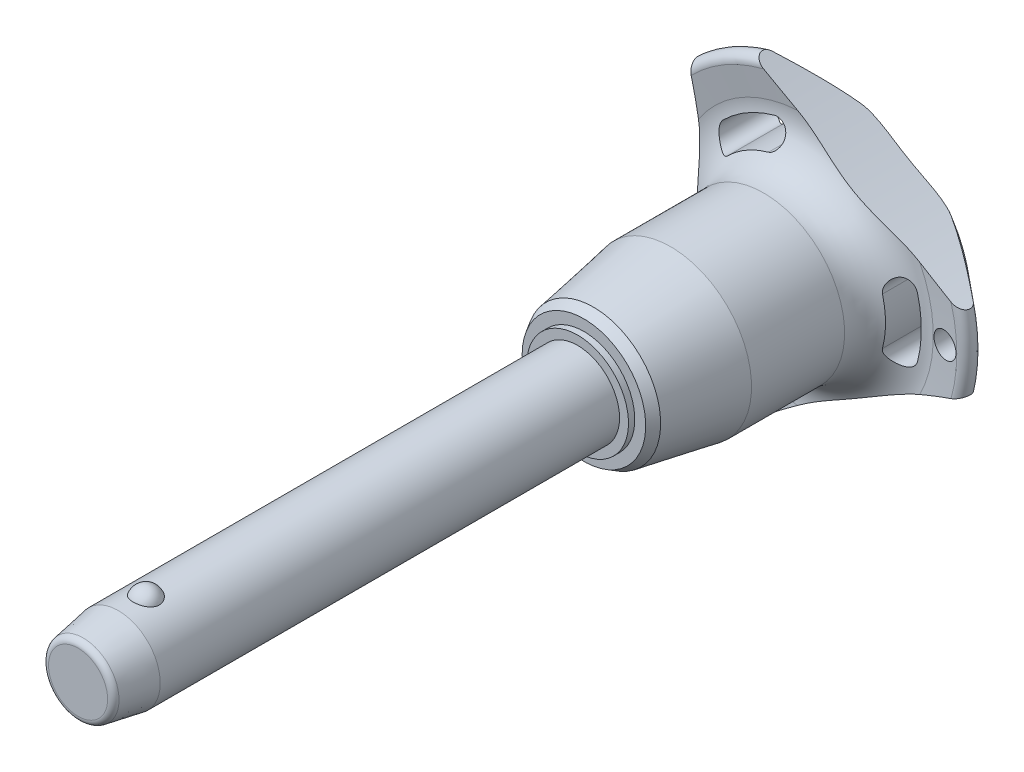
from build123d import *

# Parameters (mm, degrees)
SKETCH1_R           = 5
BOSS_EXTRUDE1_DEPTH = 50
SKETCH2_R           = 4.25
BOSS_EXTRUDE2_DEPTH = 33.3
BOSS_EXTRUDE3_START = 9.6
SKETCH1_2_R         = 5
BOSS_EXTRUDE3_DEPTH = 9.6
CHAMFER1_SIZE       = 4.8
CHAMFER1_SIZE2      = 0.846369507
FILLET1_R           = 0.75
SKETCH6_R           = 102.8
CUT_EXTRUDE1_DEPTH  = 88.794135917
CIRPATTERN1_COUNT   = 3
SKETCH7_R           = 1.5
CUT_EXTRUDE2_DEPTH  = 88.609718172


with BuildPart() as part:
    # Sketch1 → Boss-Extrude1 (new body)
    with BuildSketch(Plane.XY):
        Circle(SKETCH1_R)
    extrude(amount=-BOSS_EXTRUDE1_DEPTH)

    # Sketch2 → Boss-Extrude2 (add)
    with BuildSketch(Plane(origin=(0, 0, -50), x_dir=(-1, 0, 0), z_dir=(0, 0, -1))):
        Circle(SKETCH2_R)
    extrude(amount=BOSS_EXTRUDE2_DEPTH)

    # Sketch3 → Revolve1 (revolve)
    with BuildSketch(Plane(origin=(0, 0, 0), x_dir=(0, 0, -1), z_dir=(1, 0, 0))):
        with BuildLine():
            Line((-1.516575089, 6), (-1.516575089, 2.7))
            ThreePointArc((-1.516575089, 2.7), (0.133424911, 4.35), (-1.516575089, 6))
        make_face()
        with BuildLine():
            Line((-1.516575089, -2.7), (-1.516575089, -6))
            ThreePointArc((-1.516575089, -6), (0.133424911, -4.35), (-1.516575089, -2.7))
        make_face()
    revolve(axis=Axis((0, -2.7, 1.516575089), (0, 1, 0)))

    # Sketch1_2 → Boss-Extrude3 (add)
    with BuildSketch(Plane.XY.offset(BOSS_EXTRUDE3_START)):
        Circle(SKETCH1_2_R)
    extrude(amount=-BOSS_EXTRUDE3_DEPTH)

    # Chamfer1
    chamfer1_edges = [part.edges().sort_by_distance(p)[0] for p in [
        (-5, 0, 9.6),
    ]]
    chamfer1_side = [part.faces().sort_by_distance(p)[0] for p in [
        (-5, 0, -20.2),
    ]]
    chamfer(chamfer1_edges, length=CHAMFER1_SIZE, length2=CHAMFER1_SIZE2, reference=chamfer1_side[0])

    # Fillet1
    fillet1_edges = [part.edges().sort_by_distance(p)[0] for p in [
        (-4.153630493, 0, 9.6),
        (4.25, 0, -83.3),
    ]]
    fillet(fillet1_edges, radius=FILLET1_R)

    # Sketch4 → Revolve2 (revolve)
    with BuildSketch(Plane(origin=(0, 0, 0), x_dir=(0, 0, -1), z_dir=(1, 0, 0)), mode=Mode.PRIVATE) as revolve2_sk:
        Polygon((50, 0), (50, 6.067402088), (50.75, 6.067402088), (50.75, 7.371950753), (51.879772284, 8.024225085), (61.1, 9.65), (72.2, 9.65), (72.2, 0), align=None)
    revolve(revolve2_sk.sketch.rotate(Axis((0, 0, -72.2), (0, 0, 1)), 90), axis=Axis((0, 0, -72.2), (0, 0, 1)))

    # Sketch5 → Revolve3 (revolve)
    with BuildSketch(Plane(origin=(0, 0, 0), x_dir=(0, 0, -1), z_dir=(1, 0, 0)), mode=Mode.PRIVATE) as revolve3_sk:
        with BuildLine():
            Line((77.16082631, 15.274661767), (76.757834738, 18.475067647))
            ThreePointArc((76.757834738, 18.475067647), (77.349836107, 19.516443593), (78.516044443, 19.24278761))
            Line((78.516044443, 19.24278761), (82.835691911, 14.094832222))
            ThreePointArc((82.835691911, 14.094832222), (83.3, 12.689260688), (82.67067517, 11.349423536))
            ThreePointArc((82.67067517, 11.349423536), (79.033110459, 6.185112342), (77.75, 0))
            Line((77.75, 0), (72.2, 0))
            Line((72.2, 0), (72.2, 9.65))
            ThreePointArc((72.2, 9.65), (75.949887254, 11.342683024), (77.16082631, 15.274661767))
        make_face()
    revolve(revolve3_sk.sketch.rotate(Axis((0, 0, -77.75), (0, 0, 1)), 90), axis=Axis((0, 0, -77.75), (0, 0, 1)))

    # Sketch6 → Cut-Extrude1 (cut, through all)
    with BuildSketch(Plane.XY):
        with Locations((-115.2, 0)):
            Circle(SKETCH6_R)
        with BuildLine():
            ThreePointArc((13.411913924, -3.529271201), (13.868496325, 0), (13.411913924, 3.529271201))
            ThreePointArc((13.411913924, 3.529271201), (11.694200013, 4.531299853), (10.692171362, 2.813585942))
            ThreePointArc((10.692171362, 2.813585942), (11.056165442, 0), (10.692171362, -2.813585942))
            ThreePointArc((10.692171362, -2.813585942), (11.694200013, -4.531299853), (13.411913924, -3.529271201))
        make_face()
    cut_extrude1 = extrude(amount=-CUT_EXTRUDE1_DEPTH, mode=Mode.SUBTRACT)

    # CirPattern1: Cut-Extrude1 ×3 about axis
    cirpattern1_axis = Axis((0, 0, 0), (0, 0, 1))
    for i in range(1, CIRPATTERN1_COUNT):
        add(cut_extrude1.rotate(cirpattern1_axis, i * 360 / CIRPATTERN1_COUNT), mode=Mode.SUBTRACT)

    # Sketch7 → Cut-Extrude2 (cut, through all)
    with BuildSketch(Plane.XY):
        with Locations(Location((16.868496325, 0, 0), (0, 0, 225.467095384))):
            Circle(SKETCH7_R)
    extrude(amount=-CUT_EXTRUDE2_DEPTH, mode=Mode.SUBTRACT)


solid = part.part
